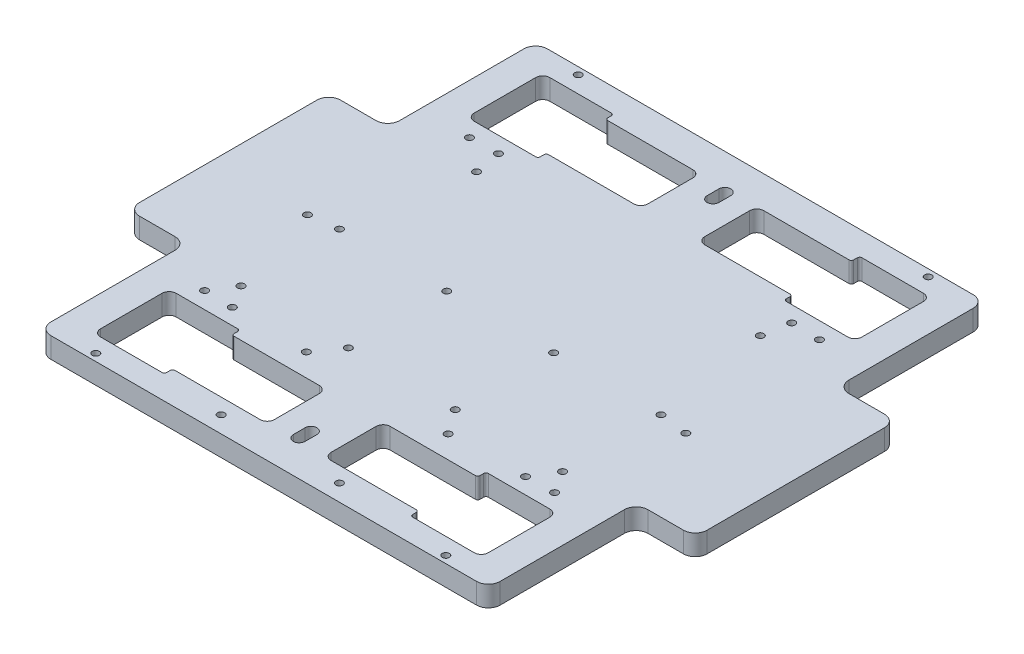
from build123d import *
from OCP.BRepFilletAPI import BRepFilletAPI_MakeFillet

# Parameters (mm, degrees)
SKETCH_1_W          = 190
SKETCH_1_H          = 210
EXTRUDE_1_DEPTH     = 8.7
SKETCH_2_W          = 25
SKETCH_2_H          = 85
EXTRUDE_2_DEPTH     = 8.7
SKETCH_3_R          = 1.5
CUT_EXTRUDE_1_DEPTH = 10
SKETCH_4_R          = 1.5
CUT_EXTRUDE_2_DEPTH = 10
SKETCH_5_R          = 1.5
CUT_EXTRUDE_3_DEPTH = 10
SKETCH_6_W          = 70
SKETCH_6_H          = 25
CUT_EXTRUDE_4_DEPTH = 10
SKETCH_7_W          = 30
SKETCH_7_H          = 32
CUT_EXTRUDE_5_DEPTH = 10
FILLET_1_R1         = 3
FILLET_1_R2         = 1
FILLET_2_R          = 5
SKETCH_8_R          = 1.5
CUT_EXTRUDE_6_DEPTH = 10
CUT_EXTRUDE_7_DEPTH = 10


with BuildPart() as part:
    # Sketch 1 → Extrude 1 (new body)
    with BuildSketch(Plane(origin=(0, 0, 0), x_dir=(1, 0, 0), z_dir=(0, 1, 0))):
        Rectangle(SKETCH_1_W, SKETCH_1_H)
    extrude(amount=EXTRUDE_1_DEPTH)

    # Sketch 2 → Extrude 2 (add)
    with BuildSketch(Plane(origin=(0, 8.7, 0), x_dir=(1, 0, 0), z_dir=(0, 1, 0))):
        with Locations((-107.5, 0)):
            Rectangle(SKETCH_2_W, SKETCH_2_H)
        with Locations((107.5, 0)):
            Rectangle(SKETCH_2_W, SKETCH_2_H)
    extrude(amount=-EXTRUDE_2_DEPTH)

    # Sketch 3 → Cut-Extrude 1 (cut)
    with BuildSketch(Plane(origin=(0, 8.7, 0), x_dir=(1, 0, 0), z_dir=(0, 1, 0))):
        with Locations(Location((-60, 45, 0), (0, 0, 270))):
            Circle(SKETCH_3_R)
        with Locations(Location((60, 45, 0), (0, 0, 270))):
            Circle(SKETCH_3_R)
        with Locations(Location((-80, -6.5, 0), (0, 0, 270))):
            Circle(SKETCH_3_R)
        with Locations(Location((80, -6.5, 0), (0, 0, 270))):
            Circle(SKETCH_3_R)
    extrude(amount=-CUT_EXTRUDE_1_DEPTH, mode=Mode.SUBTRACT)

    # Sketch 4 → Cut-Extrude 2 (cut)
    with BuildSketch(Plane(origin=(0, 8.7, 0), x_dir=(1, 0, 0), z_dir=(0, 1, 0))):
        with Locations(Location((-74, -102, 0), (0, 0, 270))):
            Circle(SKETCH_4_R)
        with Locations(Location((-74, -56, 0), (0, 0, 270))):
            Circle(SKETCH_4_R)
        with Locations(Location((-62, -56.273552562, 0), (0, 0, 270))):
            Circle(SKETCH_4_R)
        with Locations(Location((62, -56.273552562, 0), (0, 0, 270))):
            Circle(SKETCH_4_R)
        with Locations(Location((74, -56, 0), (0, 0, 270))):
            Circle(SKETCH_4_R)
        with Locations(Location((74, -102, 0), (0, 0, 270))):
            Circle(SKETCH_4_R)
        with Locations(Location((74, 102, 0), (0, 0, 270))):
            Circle(SKETCH_4_R)
        with Locations(Location((74, 56, 0), (0, 0, 270))):
            Circle(SKETCH_4_R)
        with Locations(Location((62, 56.273552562, 0), (0, 0, 270))):
            Circle(SKETCH_4_R)
        with Locations(Location((-62, 56.273552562, 0), (0, 0, 270))):
            Circle(SKETCH_4_R)
        with Locations(Location((-74, 56, 0), (0, 0, 270))):
            Circle(SKETCH_4_R)
        with Locations(Location((-74, 102, 0), (0, 0, 270))):
            Circle(SKETCH_4_R)
    extrude(amount=-CUT_EXTRUDE_2_DEPTH, mode=Mode.SUBTRACT)

    # Sketch 5 → Cut-Extrude 3 (cut)
    with BuildSketch(Plane(origin=(0, 8.7, 0), x_dir=(1, 0, 0), z_dir=(0, 1, 0))):
        with Locations(Location((-30, -57, 0), (0, 0, 270))):
            Circle(SKETCH_5_R)
        with Locations(Location((-25, -98, 0), (0, 0, 270))):
            Circle(SKETCH_5_R)
        with Locations(Location((25, -98, 0), (0, 0, 270))):
            Circle(SKETCH_5_R)
        with Locations(Location((30, -57, 0), (0, 0, 270))):
            Circle(SKETCH_5_R)
    extrude(amount=-CUT_EXTRUDE_3_DEPTH, mode=Mode.SUBTRACT)

    # Sketch 6 → Cut-Extrude 4 (cut)
    with BuildSketch(Plane(origin=(0, 8.7, 0), x_dir=(1, 0, 0), z_dir=(0, 1, 0))):
        with Locations((-47, -79)):
            Rectangle(SKETCH_6_W, SKETCH_6_H)
        with Locations((47, -79)):
            Rectangle(SKETCH_6_W, SKETCH_6_H)
        with Locations((47, 79)):
            Rectangle(SKETCH_6_W, SKETCH_6_H)
        with Locations((-47, 79)):
            Rectangle(SKETCH_6_W, SKETCH_6_H)
    extrude(amount=-CUT_EXTRUDE_4_DEPTH, mode=Mode.SUBTRACT)

    # Sketch 7 → Cut-Extrude 5 (cut)
    with BuildSketch(Plane(origin=(0, 8.7, 0), x_dir=(1, 0, 0), z_dir=(0, 1, 0))):
        with Locations((-67, -79)):
            Rectangle(SKETCH_7_W, SKETCH_7_H)
        with Locations((67, -79)):
            Rectangle(SKETCH_7_W, SKETCH_7_H)
        with Locations((67, 79)):
            Rectangle(SKETCH_7_W, SKETCH_7_H)
        with Locations((-67, 79)):
            Rectangle(SKETCH_7_W, SKETCH_7_H)
    extrude(amount=-CUT_EXTRUDE_5_DEPTH, mode=Mode.SUBTRACT)

    # Fillet 1: one fillet with a radius per group of edges: ONE call of the kernel's fillet builder (fillet() takes one radius for all edges)
    fillet_1_edges_1 = [part.edges().sort_by_distance(p)[0] for p in [
        (-12, 4.35, 66.5),
        (-82, 4.35, 95),
        (-82, 4.35, 63),
        (-12, 4.35, 91.5),
        (12, 4.35, 91.5),
        (12, 4.35, 66.5),
        (82, 4.35, 63),
        (82, 4.35, 95),
        (82, 4.35, -63),
        (82, 4.35, -95),
        (12, 4.35, -66.5),
        (12, 4.35, -91.5),
        (-82, 4.35, -63),
        (-82, 4.35, -95),
        (-12, 4.35, -91.5),
        (-12, 4.35, -66.5),
    ]]
    fillet_1_edges_2 = [part.edges().sort_by_distance(p)[0] for p in [
        (-52, 4.35, 66.5),
        (-52, 4.35, 63),
        (-52, 4.35, 91.5),
        (-52, 4.35, 95),
        (52, 4.35, 95),
        (52, 4.35, 91.5),
        (52, 4.35, 66.5),
        (52, 4.35, 63),
        (52, 4.35, -63),
        (52, 4.35, -66.5),
        (52, 4.35, -95),
        (52, 4.35, -91.5),
        (-52, 4.35, -91.5),
        (-52, 4.35, -95),
        (-52, 4.35, -66.5),
        (-52, 4.35, -63),
    ]]
    fillet_1 = BRepFilletAPI_MakeFillet(part.part.solid().wrapped)
    for e in fillet_1_edges_1:
        fillet_1.Add(FILLET_1_R1, e.wrapped)
    for e in fillet_1_edges_2:
        fillet_1.Add(FILLET_1_R2, e.wrapped)
    add(Compound.cast(fillet_1.Shape()), mode=Mode.REPLACE)

    # Fillet 2
    fillet_2_edges = [part.edges().sort_by_distance(p)[0] for p in [
        (-95, 4.35, -42.5),
        (-95, 4.35, 42.5),
        (-120, 4.35, 42.5),
        (-120, 4.35, -42.5),
        (95, 4.35, -42.5),
        (120, 4.35, -42.5),
        (120, 4.35, 42.5),
        (95, 4.35, 42.5),
        (95, 4.35, 105),
        (-95, 4.35, 105),
        (-95, 4.35, -105),
        (95, 4.35, -105),
    ]]
    fillet(fillet_2_edges, radius=FILLET_2_R)

    # Sketch 8 → Cut-Extrude 6 (cut)
    with BuildSketch(Plane(origin=(0, 8.7, 0), x_dir=(1, 0, 0), z_dir=(0, 1, 0))):
        with Locations(Location((-68, -5, 0), (0, 0, 270))):
            Circle(SKETCH_8_R)
        with Locations(Location((-68, -46.6, 0), (0, 0, 270))):
            Circle(SKETCH_8_R)
        with Locations(Location((-22.6, -46.6, 0), (0, 0, 270))):
            Circle(SKETCH_8_R)
        with Locations(Location((-22.6, -5, 0), (0, 0, 270))):
            Circle(SKETCH_8_R)
        with Locations(Location((22.6, -5, 0), (0, 0, 270))):
            Circle(SKETCH_8_R)
        with Locations(Location((22.6, -46.6, 0), (0, 0, 270))):
            Circle(SKETCH_8_R)
        with Locations(Location((68, -46.6, 0), (0, 0, 270))):
            Circle(SKETCH_8_R)
        with Locations(Location((68, -5, 0), (0, 0, 270))):
            Circle(SKETCH_8_R)
    extrude(amount=-CUT_EXTRUDE_6_DEPTH, mode=Mode.SUBTRACT)

    # Sketch 9 → Cut-Extrude 7 (cut)
    with BuildSketch(Plane(origin=(0, 8.7, 0), x_dir=(1, 0, 0), z_dir=(0, 1, 0))):
        with BuildLine():
            Line((2.5, 90), (2.5, 85))
            ThreePointArc((2.5, 85), (0, 82.5), (-2.5, 85))
            Line((-2.5, 85), (-2.5, 90))
            ThreePointArc((-2.5, 90), (0, 92.5), (2.5, 90))
        make_face()
        with BuildLine():
            Line((2.5, -90), (2.5, -85))
            ThreePointArc((2.5, -85), (0, -82.5), (-2.5, -85))
            Line((-2.5, -85), (-2.5, -90))
            ThreePointArc((-2.5, -90), (0, -92.5), (2.5, -90))
        make_face()
    extrude(amount=-CUT_EXTRUDE_7_DEPTH, mode=Mode.SUBTRACT)


solid = part.part
